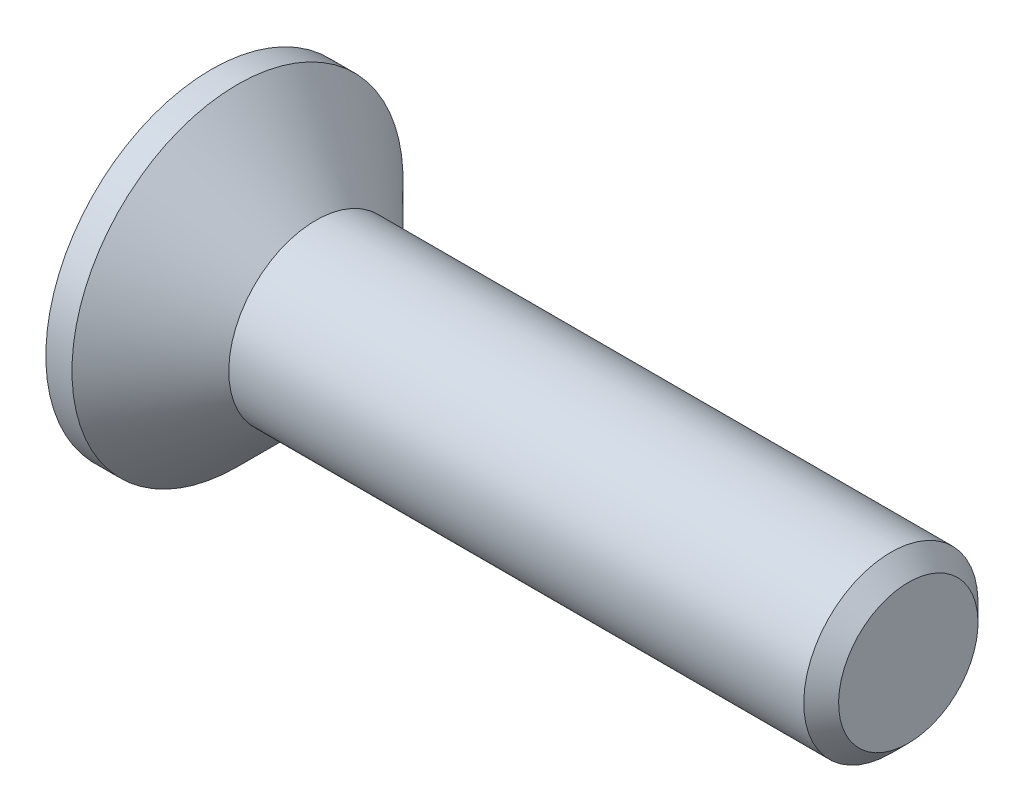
ISO-10303-21;
HEADER;
FILE_DESCRIPTION(('STEP AP214'),'2;1');
FILE_NAME('part.step','',(''),(''),'','','');
FILE_SCHEMA(('AUTOMOTIVE_DESIGN { 1 0 10303 214 1 1 1 1 }'));
ENDSEC;
DATA;
#1=APPLICATION_CONTEXT('core data for automotive mechanical design processes');
#2=APPLICATION_PROTOCOL_DEFINITION('international standard','automotive_design',2000,#1);
#3=PRODUCT_CONTEXT('',#1,'mechanical');
#4=PRODUCT('Part','Part','',(#3));
#5=PRODUCT_RELATED_PRODUCT_CATEGORY('part','',(#4));
#6=PRODUCT_DEFINITION_FORMATION('','',#4);
#7=PRODUCT_DEFINITION_CONTEXT('part definition',#1,'design');
#8=PRODUCT_DEFINITION('design','',#6,#7);
#9=PRODUCT_DEFINITION_SHAPE('','',#8);
#10=(LENGTH_UNIT() NAMED_UNIT(*) SI_UNIT(.MILLI.,.METRE.));
#11=(NAMED_UNIT(*) PLANE_ANGLE_UNIT() SI_UNIT($,.RADIAN.));
#12=(NAMED_UNIT(*) SI_UNIT($,.STERADIAN.) SOLID_ANGLE_UNIT());
#13=UNCERTAINTY_MEASURE_WITH_UNIT(LENGTH_MEASURE(1.E-05),#10,'distance_accuracy_value','');
#14=(GEOMETRIC_REPRESENTATION_CONTEXT(3) GLOBAL_UNCERTAINTY_ASSIGNED_CONTEXT((#13)) GLOBAL_UNIT_ASSIGNED_CONTEXT((#10,
#11,#12)) REPRESENTATION_CONTEXT('',''));
#15=CARTESIAN_POINT('',(0.,0.,0.));
#16=DIRECTION('',(0.,0.,1.));
#17=DIRECTION('',(1.,0.,0.));
#18=AXIS2_PLACEMENT_3D('',#15,#16,#17);
#19=CARTESIAN_POINT('',(0.,0.,0.));
#20=DIRECTION('',(-1.,0.,0.));
#21=DIRECTION('',(0.,-1.,0.));
#22=AXIS2_PLACEMENT_3D('',#19,#20,#21);
#23=CONICAL_SURFACE('',#22,1.,0.78539816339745);
#24=CARTESIAN_POINT('',(-0.899999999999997,0.,0.));
#25=DIRECTION('',(-1.,0.,0.));
#26=DIRECTION('',(0.,-1.,0.));
#27=AXIS2_PLACEMENT_3D('',#24,#25,#26);
#28=CIRCLE('',#27,1.9);
#29=CARTESIAN_POINT('',(-0.899999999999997,-1.9,0.));
#30=VERTEX_POINT('',#29);
#31=EDGE_CURVE('E189',#30,#30,#28,.T.);
#32=ORIENTED_EDGE('',*,*,#31,.F.);
#33=EDGE_LOOP('',(#32));
#34=FACE_BOUND('',#33,.T.);
#35=CARTESIAN_POINT('',(0.,0.,0.));
#36=DIRECTION('',(-1.,0.,0.));
#37=DIRECTION('',(0.,-1.,0.));
#38=AXIS2_PLACEMENT_3D('',#35,#36,#37);
#39=CIRCLE('',#38,1.);
#40=CARTESIAN_POINT('',(0.,-1.,0.));
#41=VERTEX_POINT('',#40);
#42=EDGE_CURVE('E212',#41,#41,#39,.T.);
#43=ORIENTED_EDGE('',*,*,#42,.T.);
#44=EDGE_LOOP('',(#43));
#45=FACE_BOUND('',#44,.T.);
#46=ADVANCED_FACE('F33',(#34,#45),#23,.T.);
#47=CARTESIAN_POINT('',(-1.2,0.,0.));
#48=DIRECTION('',(-1.,0.,0.));
#49=DIRECTION('',(0.,-1.,0.));
#50=AXIS2_PLACEMENT_3D('',#47,#48,#49);
#51=CYLINDRICAL_SURFACE('',#50,1.);
#52=CARTESIAN_POINT('',(6.6,0.,0.));
#53=DIRECTION('',(-1.,0.,0.));
#54=DIRECTION('',(0.,-1.,0.));
#55=AXIS2_PLACEMENT_3D('',#52,#53,#54);
#56=CIRCLE('',#55,1.);
#57=CARTESIAN_POINT('',(6.6,-1.,0.));
#58=VERTEX_POINT('',#57);
#59=EDGE_CURVE('E41',#58,#58,#56,.T.);
#60=ORIENTED_EDGE('',*,*,#59,.T.);
#61=EDGE_LOOP('',(#60));
#62=FACE_BOUND('',#61,.T.);
#63=ORIENTED_EDGE('',*,*,#42,.F.);
#64=EDGE_LOOP('',(#63));
#65=FACE_BOUND('',#64,.T.);
#66=ADVANCED_FACE('F217',(#62,#65),#51,.T.);
#67=CARTESIAN_POINT('',(6.8,0.,0.));
#68=DIRECTION('',(-1.,0.,0.));
#69=DIRECTION('',(0.,-1.,0.));
#70=AXIS2_PLACEMENT_3D('',#67,#68,#69);
#71=PLANE('',#70);
#72=CARTESIAN_POINT('',(6.8,0.,0.));
#73=DIRECTION('',(-1.,0.,0.));
#74=DIRECTION('',(0.,-1.,0.));
#75=AXIS2_PLACEMENT_3D('',#72,#73,#74);
#76=CIRCLE('',#75,0.8);
#77=CARTESIAN_POINT('',(6.8,-0.8,0.));
#78=VERTEX_POINT('',#77);
#79=EDGE_CURVE('E11',#78,#78,#76,.F.);
#80=ORIENTED_EDGE('',*,*,#79,.T.);
#81=EDGE_LOOP('',(#80));
#82=FACE_BOUND('',#81,.T.);
#83=ADVANCED_FACE('F239',(#82),#71,.F.);
#84=CARTESIAN_POINT('',(-1.2,1.9,0.));
#85=DIRECTION('',(1.,0.,0.));
#86=DIRECTION('',(0.,1.,0.));
#87=AXIS2_PLACEMENT_3D('',#84,#85,#86);
#88=PLANE('',#87);
#89=DIRECTION('',(0.,0.,-1.));
#90=VECTOR('',#89,1.);
#91=CARTESIAN_POINT('',(-1.2,0.3,-1.175));
#92=LINE('',#91,#90);
#93=CARTESIAN_POINT('',(-1.2,0.3,-0.3));
#94=VERTEX_POINT('',#93);
#95=CARTESIAN_POINT('',(-1.2,0.3,-1.175));
#96=VERTEX_POINT('',#95);
#97=EDGE_CURVE('E158',#94,#96,#92,.T.);
#98=ORIENTED_EDGE('',*,*,#97,.F.);
#99=DIRECTION('',(0.,-1.,0.));
#100=VECTOR('',#99,1.);
#101=CARTESIAN_POINT('',(-1.2,0.3,-0.3));
#102=LINE('',#101,#100);
#103=CARTESIAN_POINT('',(-1.2,1.175,-0.3));
#104=VERTEX_POINT('',#103);
#105=EDGE_CURVE('E48',#104,#94,#102,.T.);
#106=ORIENTED_EDGE('',*,*,#105,.F.);
#107=DIRECTION('',(0.,0.,-1.));
#108=VECTOR('',#107,1.);
#109=CARTESIAN_POINT('',(-1.2,1.175,-0.3));
#110=LINE('',#109,#108);
#111=CARTESIAN_POINT('',(-1.2,1.175,0.3));
#112=VERTEX_POINT('',#111);
#113=EDGE_CURVE('E185',#112,#104,#110,.T.);
#114=ORIENTED_EDGE('',*,*,#113,.F.);
#115=DIRECTION('',(0.,1.,0.));
#116=VECTOR('',#115,1.);
#117=CARTESIAN_POINT('',(-1.2,1.175,0.3));
#118=LINE('',#117,#116);
#119=CARTESIAN_POINT('',(-1.2,0.3,0.3));
#120=VERTEX_POINT('',#119);
#121=EDGE_CURVE('E183',#120,#112,#118,.T.);
#122=ORIENTED_EDGE('',*,*,#121,.F.);
#123=DIRECTION('',(0.,0.,-1.));
#124=VECTOR('',#123,1.);
#125=CARTESIAN_POINT('',(-1.2,0.3,0.3));
#126=LINE('',#125,#124);
#127=CARTESIAN_POINT('',(-1.2,0.3,1.175));
#128=VERTEX_POINT('',#127);
#129=EDGE_CURVE('E132',#128,#120,#126,.T.);
#130=ORIENTED_EDGE('',*,*,#129,.F.);
#131=DIRECTION('',(0.,1.,0.));
#132=VECTOR('',#131,1.);
#133=CARTESIAN_POINT('',(-1.2,0.3,1.175));
#134=LINE('',#133,#132);
#135=CARTESIAN_POINT('',(-1.2,-0.3,1.175));
#136=VERTEX_POINT('',#135);
#137=EDGE_CURVE('E179',#136,#128,#134,.T.);
#138=ORIENTED_EDGE('',*,*,#137,.F.);
#139=DIRECTION('',(0.,0.,1.));
#140=VECTOR('',#139,1.);
#141=CARTESIAN_POINT('',(-1.2,-0.3,1.175));
#142=LINE('',#141,#140);
#143=CARTESIAN_POINT('',(-1.2,-0.3,0.3));
#144=VERTEX_POINT('',#143);
#145=EDGE_CURVE('E176',#144,#136,#142,.T.);
#146=ORIENTED_EDGE('',*,*,#145,.F.);
#147=DIRECTION('',(0.,1.,0.));
#148=VECTOR('',#147,1.);
#149=CARTESIAN_POINT('',(-1.2,-0.3,0.3));
#150=LINE('',#149,#148);
#151=CARTESIAN_POINT('',(-1.2,-1.175,0.3));
#152=VERTEX_POINT('',#151);
#153=EDGE_CURVE('E173',#152,#144,#150,.T.);
#154=ORIENTED_EDGE('',*,*,#153,.F.);
#155=DIRECTION('',(0.,0.,1.));
#156=VECTOR('',#155,1.);
#157=CARTESIAN_POINT('',(-1.2,-1.175,0.3));
#158=LINE('',#157,#156);
#159=CARTESIAN_POINT('',(-1.2,-1.175,-0.3));
#160=VERTEX_POINT('',#159);
#161=EDGE_CURVE('E170',#160,#152,#158,.T.);
#162=ORIENTED_EDGE('',*,*,#161,.F.);
#163=DIRECTION('',(0.,-1.,0.));
#164=VECTOR('',#163,1.);
#165=CARTESIAN_POINT('',(-1.2,-1.175,-0.3));
#166=LINE('',#165,#164);
#167=CARTESIAN_POINT('',(-1.2,-0.3,-0.3));
#168=VERTEX_POINT('',#167);
#169=EDGE_CURVE('E167',#168,#160,#166,.T.);
#170=ORIENTED_EDGE('',*,*,#169,.F.);
#171=DIRECTION('',(0.,0.,1.));
#172=VECTOR('',#171,1.);
#173=CARTESIAN_POINT('',(-1.2,-0.3,-0.3));
#174=LINE('',#173,#172);
#175=CARTESIAN_POINT('',(-1.2,-0.3,-1.175));
#176=VERTEX_POINT('',#175);
#177=EDGE_CURVE('E164',#176,#168,#174,.T.);
#178=ORIENTED_EDGE('',*,*,#177,.F.);
#179=DIRECTION('',(0.,-1.,0.));
#180=VECTOR('',#179,1.);
#181=CARTESIAN_POINT('',(-1.2,-0.3,-1.175));
#182=LINE('',#181,#180);
#183=EDGE_CURVE('E161',#96,#176,#182,.T.);
#184=ORIENTED_EDGE('',*,*,#183,.F.);
#185=EDGE_LOOP('',(#98,#106,#114,#122,#130,#138,#146,#154,#162,#170,#178,#184));
#186=FACE_BOUND('',#185,.T.);
#187=CARTESIAN_POINT('',(-1.2,0.,0.));
#188=DIRECTION('',(-1.,0.,0.));
#189=DIRECTION('',(0.,-1.,0.));
#190=AXIS2_PLACEMENT_3D('',#187,#188,#189);
#191=CIRCLE('',#190,1.9);
#192=CARTESIAN_POINT('',(-1.2,-1.9,0.));
#193=VERTEX_POINT('',#192);
#194=EDGE_CURVE('E209',#193,#193,#191,.T.);
#195=ORIENTED_EDGE('',*,*,#194,.T.);
#196=EDGE_LOOP('',(#195));
#197=FACE_BOUND('',#196,.T.);
#198=ADVANCED_FACE('F230',(#186,#197),#88,.F.);
#199=CARTESIAN_POINT('',(-1.2,0.,0.));
#200=DIRECTION('',(-1.,0.,0.));
#201=DIRECTION('',(0.,-1.,0.));
#202=AXIS2_PLACEMENT_3D('',#199,#200,#201);
#203=CYLINDRICAL_SURFACE('',#202,1.9);
#204=ORIENTED_EDGE('',*,*,#194,.F.);
#205=EDGE_LOOP('',(#204));
#206=FACE_BOUND('',#205,.T.);
#207=ORIENTED_EDGE('',*,*,#31,.T.);
#208=EDGE_LOOP('',(#207));
#209=FACE_BOUND('',#208,.T.);
#210=ADVANCED_FACE('F222',(#206,#209),#203,.T.);
#211=CARTESIAN_POINT('',(6.6,0.,0.));
#212=DIRECTION('',(-1.,0.,0.));
#213=DIRECTION('',(0.,-1.,0.));
#214=AXIS2_PLACEMENT_3D('',#211,#212,#213);
#215=CONICAL_SURFACE('',#214,1.,0.78539816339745);
#216=ORIENTED_EDGE('',*,*,#79,.F.);
#217=EDGE_LOOP('',(#216));
#218=FACE_BOUND('',#217,.T.);
#219=ORIENTED_EDGE('',*,*,#59,.F.);
#220=EDGE_LOOP('',(#219));
#221=FACE_BOUND('',#220,.T.);
#222=ADVANCED_FACE('F35',(#218,#221),#215,.T.);
#223=CARTESIAN_POINT('',(-0.249999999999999,0.3,-0.3));
#224=DIRECTION('',(0.,0.,-1.));
#225=DIRECTION('',(0.,1.,0.));
#226=AXIS2_PLACEMENT_3D('',#223,#224,#225);
#227=PLANE('',#226);
#228=ORIENTED_EDGE('',*,*,#105,.T.);
#229=DIRECTION('',(-1.,0.,0.));
#230=VECTOR('',#229,1.);
#231=CARTESIAN_POINT('',(-0.249999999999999,0.3,-0.3));
#232=LINE('',#231,#230);
#233=CARTESIAN_POINT('',(-0.249999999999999,0.3,-0.3));
#234=VERTEX_POINT('',#233);
#235=EDGE_CURVE('E96',#234,#94,#232,.T.);
#236=ORIENTED_EDGE('',*,*,#235,.F.);
#237=DIRECTION('',(0.,-1.,0.));
#238=VECTOR('',#237,1.);
#239=CARTESIAN_POINT('',(-0.249999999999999,0.3,-0.3));
#240=LINE('',#239,#238);
#241=CARTESIAN_POINT('',(-0.249999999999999,1.175,-0.3));
#242=VERTEX_POINT('',#241);
#243=EDGE_CURVE('E187',#242,#234,#240,.T.);
#244=ORIENTED_EDGE('',*,*,#243,.F.);
#245=DIRECTION('',(-1.,0.,0.));
#246=VECTOR('',#245,1.);
#247=CARTESIAN_POINT('',(-0.249999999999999,1.175,-0.3));
#248=LINE('',#247,#246);
#249=EDGE_CURVE('E56',#242,#104,#248,.T.);
#250=ORIENTED_EDGE('',*,*,#249,.T.);
#251=EDGE_LOOP('',(#228,#236,#244,#250));
#252=FACE_BOUND('',#251,.T.);
#253=ADVANCED_FACE('F221',(#252),#227,.F.);
#254=CARTESIAN_POINT('',(-0.249999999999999,1.175,-0.3));
#255=DIRECTION('',(0.,1.,0.));
#256=DIRECTION('',(-1.,0.,0.));
#257=AXIS2_PLACEMENT_3D('',#254,#255,#256);
#258=PLANE('',#257);
#259=ORIENTED_EDGE('',*,*,#113,.T.);
#260=ORIENTED_EDGE('',*,*,#249,.F.);
#261=DIRECTION('',(0.,0.,-1.));
#262=VECTOR('',#261,1.);
#263=CARTESIAN_POINT('',(-0.249999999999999,1.175,-0.3));
#264=LINE('',#263,#262);
#265=CARTESIAN_POINT('',(-0.249999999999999,1.175,0.3));
#266=VERTEX_POINT('',#265);
#267=EDGE_CURVE('E144',#266,#242,#264,.T.);
#268=ORIENTED_EDGE('',*,*,#267,.F.);
#269=DIRECTION('',(-1.,0.,0.));
#270=VECTOR('',#269,1.);
#271=CARTESIAN_POINT('',(-0.249999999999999,1.175,0.3));
#272=LINE('',#271,#270);
#273=EDGE_CURVE('E136',#266,#112,#272,.T.);
#274=ORIENTED_EDGE('',*,*,#273,.T.);
#275=EDGE_LOOP('',(#259,#260,#268,#274));
#276=FACE_BOUND('',#275,.T.);
#277=ADVANCED_FACE('F228',(#276),#258,.F.);
#278=CARTESIAN_POINT('',(-0.249999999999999,1.175,0.3));
#279=DIRECTION('',(0.,0.,1.));
#280=DIRECTION('',(0.,-1.,0.));
#281=AXIS2_PLACEMENT_3D('',#278,#279,#280);
#282=PLANE('',#281);
#283=ORIENTED_EDGE('',*,*,#121,.T.);
#284=ORIENTED_EDGE('',*,*,#273,.F.);
#285=DIRECTION('',(0.,1.,0.));
#286=VECTOR('',#285,1.);
#287=CARTESIAN_POINT('',(-0.249999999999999,1.175,0.3));
#288=LINE('',#287,#286);
#289=CARTESIAN_POINT('',(-0.249999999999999,0.3,0.3));
#290=VERTEX_POINT('',#289);
#291=EDGE_CURVE('E140',#290,#266,#288,.T.);
#292=ORIENTED_EDGE('',*,*,#291,.F.);
#293=DIRECTION('',(-1.,0.,0.));
#294=VECTOR('',#293,1.);
#295=CARTESIAN_POINT('',(-0.249999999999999,0.3,0.3));
#296=LINE('',#295,#294);
#297=EDGE_CURVE('E125',#290,#120,#296,.T.);
#298=ORIENTED_EDGE('',*,*,#297,.T.);
#299=EDGE_LOOP('',(#283,#284,#292,#298));
#300=FACE_BOUND('',#299,.T.);
#301=ADVANCED_FACE('F141',(#300),#282,.F.);
#302=CARTESIAN_POINT('',(-0.249999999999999,0.3,0.3));
#303=DIRECTION('',(0.,1.,0.));
#304=DIRECTION('',(0.,0.,1.));
#305=AXIS2_PLACEMENT_3D('',#302,#303,#304);
#306=PLANE('',#305);
#307=ORIENTED_EDGE('',*,*,#129,.T.);
#308=ORIENTED_EDGE('',*,*,#297,.F.);
#309=DIRECTION('',(0.,0.,-1.));
#310=VECTOR('',#309,1.);
#311=CARTESIAN_POINT('',(-0.249999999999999,0.3,0.3));
#312=LINE('',#311,#310);
#313=CARTESIAN_POINT('',(-0.249999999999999,0.3,1.175));
#314=VERTEX_POINT('',#313);
#315=EDGE_CURVE('E129',#314,#290,#312,.T.);
#316=ORIENTED_EDGE('',*,*,#315,.F.);
#317=DIRECTION('',(-1.,0.,0.));
#318=VECTOR('',#317,1.);
#319=CARTESIAN_POINT('',(-0.249999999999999,0.3,1.175));
#320=LINE('',#319,#318);
#321=EDGE_CURVE('E137',#314,#128,#320,.T.);
#322=ORIENTED_EDGE('',*,*,#321,.T.);
#323=EDGE_LOOP('',(#307,#308,#316,#322));
#324=FACE_BOUND('',#323,.T.);
#325=ADVANCED_FACE('F127',(#324),#306,.F.);
#326=CARTESIAN_POINT('',(-0.249999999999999,0.3,1.175));
#327=DIRECTION('',(0.,0.,1.));
#328=DIRECTION('',(1.,0.,0.));
#329=AXIS2_PLACEMENT_3D('',#326,#327,#328);
#330=PLANE('',#329);
#331=ORIENTED_EDGE('',*,*,#137,.T.);
#332=ORIENTED_EDGE('',*,*,#321,.F.);
#333=DIRECTION('',(0.,1.,0.));
#334=VECTOR('',#333,1.);
#335=CARTESIAN_POINT('',(-0.249999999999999,0.3,1.175));
#336=LINE('',#335,#334);
#337=CARTESIAN_POINT('',(-0.249999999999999,-0.3,1.175));
#338=VERTEX_POINT('',#337);
#339=EDGE_CURVE('E150',#338,#314,#336,.T.);
#340=ORIENTED_EDGE('',*,*,#339,.F.);
#341=DIRECTION('',(-1.,0.,0.));
#342=VECTOR('',#341,1.);
#343=CARTESIAN_POINT('',(-0.249999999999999,-0.3,1.175));
#344=LINE('',#343,#342);
#345=EDGE_CURVE('E192',#338,#136,#344,.T.);
#346=ORIENTED_EDGE('',*,*,#345,.T.);
#347=EDGE_LOOP('',(#331,#332,#340,#346));
#348=FACE_BOUND('',#347,.T.);
#349=ADVANCED_FACE('F277',(#348),#330,.F.);
#350=CARTESIAN_POINT('',(-0.249999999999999,-0.3,1.175));
#351=DIRECTION('',(0.,-1.,0.));
#352=DIRECTION('',(0.,0.,-1.));
#353=AXIS2_PLACEMENT_3D('',#350,#351,#352);
#354=PLANE('',#353);
#355=ORIENTED_EDGE('',*,*,#145,.T.);
#356=ORIENTED_EDGE('',*,*,#345,.F.);
#357=DIRECTION('',(0.,0.,1.));
#358=VECTOR('',#357,1.);
#359=CARTESIAN_POINT('',(-0.249999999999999,-0.3,1.175));
#360=LINE('',#359,#358);
#361=CARTESIAN_POINT('',(-0.249999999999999,-0.3,0.3));
#362=VERTEX_POINT('',#361);
#363=EDGE_CURVE('E152',#362,#338,#360,.T.);
#364=ORIENTED_EDGE('',*,*,#363,.F.);
#365=DIRECTION('',(-1.,0.,0.));
#366=VECTOR('',#365,1.);
#367=CARTESIAN_POINT('',(-0.249999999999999,-0.3,0.3));
#368=LINE('',#367,#366);
#369=EDGE_CURVE('E194',#362,#144,#368,.T.);
#370=ORIENTED_EDGE('',*,*,#369,.T.);
#371=EDGE_LOOP('',(#355,#356,#364,#370));
#372=FACE_BOUND('',#371,.T.);
#373=ADVANCED_FACE('F273',(#372),#354,.F.);
#374=CARTESIAN_POINT('',(-0.249999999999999,-0.3,0.3));
#375=DIRECTION('',(0.,0.,1.));
#376=DIRECTION('',(1.,0.,0.));
#377=AXIS2_PLACEMENT_3D('',#374,#375,#376);
#378=PLANE('',#377);
#379=ORIENTED_EDGE('',*,*,#153,.T.);
#380=ORIENTED_EDGE('',*,*,#369,.F.);
#381=DIRECTION('',(0.,1.,0.));
#382=VECTOR('',#381,1.);
#383=CARTESIAN_POINT('',(-0.249999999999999,-0.3,0.3));
#384=LINE('',#383,#382);
#385=CARTESIAN_POINT('',(-0.249999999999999,-1.175,0.3));
#386=VERTEX_POINT('',#385);
#387=EDGE_CURVE('E422',#386,#362,#384,.T.);
#388=ORIENTED_EDGE('',*,*,#387,.F.);
#389=DIRECTION('',(-1.,0.,0.));
#390=VECTOR('',#389,1.);
#391=CARTESIAN_POINT('',(-0.249999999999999,-1.175,0.3));
#392=LINE('',#391,#390);
#393=EDGE_CURVE('E196',#386,#152,#392,.T.);
#394=ORIENTED_EDGE('',*,*,#393,.T.);
#395=EDGE_LOOP('',(#379,#380,#388,#394));
#396=FACE_BOUND('',#395,.T.);
#397=ADVANCED_FACE('F269',(#396),#378,.F.);
#398=CARTESIAN_POINT('',(-0.249999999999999,-1.175,0.3));
#399=DIRECTION('',(0.,-1.,0.));
#400=DIRECTION('',(1.,0.,0.));
#401=AXIS2_PLACEMENT_3D('',#398,#399,#400);
#402=PLANE('',#401);
#403=ORIENTED_EDGE('',*,*,#161,.T.);
#404=ORIENTED_EDGE('',*,*,#393,.F.);
#405=DIRECTION('',(0.,0.,1.));
#406=VECTOR('',#405,1.);
#407=CARTESIAN_POINT('',(-0.249999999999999,-1.175,0.3));
#408=LINE('',#407,#406);
#409=CARTESIAN_POINT('',(-0.249999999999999,-1.175,-0.3));
#410=VERTEX_POINT('',#409);
#411=EDGE_CURVE('E419',#410,#386,#408,.T.);
#412=ORIENTED_EDGE('',*,*,#411,.F.);
#413=DIRECTION('',(-1.,0.,0.));
#414=VECTOR('',#413,1.);
#415=CARTESIAN_POINT('',(-0.249999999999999,-1.175,-0.3));
#416=LINE('',#415,#414);
#417=EDGE_CURVE('E198',#410,#160,#416,.T.);
#418=ORIENTED_EDGE('',*,*,#417,.T.);
#419=EDGE_LOOP('',(#403,#404,#412,#418));
#420=FACE_BOUND('',#419,.T.);
#421=ADVANCED_FACE('F265',(#420),#402,.F.);
#422=CARTESIAN_POINT('',(-0.249999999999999,-1.175,-0.3));
#423=DIRECTION('',(0.,0.,-1.));
#424=DIRECTION('',(0.,1.,0.));
#425=AXIS2_PLACEMENT_3D('',#422,#423,#424);
#426=PLANE('',#425);
#427=ORIENTED_EDGE('',*,*,#169,.T.);
#428=ORIENTED_EDGE('',*,*,#417,.F.);
#429=DIRECTION('',(0.,-1.,0.));
#430=VECTOR('',#429,1.);
#431=CARTESIAN_POINT('',(-0.249999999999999,-1.175,-0.3));
#432=LINE('',#431,#430);
#433=CARTESIAN_POINT('',(-0.249999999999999,-0.3,-0.3));
#434=VERTEX_POINT('',#433);
#435=EDGE_CURVE('E416',#434,#410,#432,.T.);
#436=ORIENTED_EDGE('',*,*,#435,.F.);
#437=DIRECTION('',(-1.,0.,0.));
#438=VECTOR('',#437,1.);
#439=CARTESIAN_POINT('',(-0.249999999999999,-0.3,-0.3));
#440=LINE('',#439,#438);
#441=EDGE_CURVE('E200',#434,#168,#440,.T.);
#442=ORIENTED_EDGE('',*,*,#441,.T.);
#443=EDGE_LOOP('',(#427,#428,#436,#442));
#444=FACE_BOUND('',#443,.T.);
#445=ADVANCED_FACE('F261',(#444),#426,.F.);
#446=CARTESIAN_POINT('',(-0.249999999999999,-0.3,-0.3));
#447=DIRECTION('',(0.,-1.,0.));
#448=DIRECTION('',(0.,0.,-1.));
#449=AXIS2_PLACEMENT_3D('',#446,#447,#448);
#450=PLANE('',#449);
#451=ORIENTED_EDGE('',*,*,#177,.T.);
#452=ORIENTED_EDGE('',*,*,#441,.F.);
#453=DIRECTION('',(0.,0.,1.));
#454=VECTOR('',#453,1.);
#455=CARTESIAN_POINT('',(-0.249999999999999,-0.3,-0.3));
#456=LINE('',#455,#454);
#457=CARTESIAN_POINT('',(-0.249999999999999,-0.3,-1.175));
#458=VERTEX_POINT('',#457);
#459=EDGE_CURVE('E413',#458,#434,#456,.T.);
#460=ORIENTED_EDGE('',*,*,#459,.F.);
#461=DIRECTION('',(-1.,0.,0.));
#462=VECTOR('',#461,1.);
#463=CARTESIAN_POINT('',(-0.249999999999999,-0.3,-1.175));
#464=LINE('',#463,#462);
#465=EDGE_CURVE('E202',#458,#176,#464,.T.);
#466=ORIENTED_EDGE('',*,*,#465,.T.);
#467=EDGE_LOOP('',(#451,#452,#460,#466));
#468=FACE_BOUND('',#467,.T.);
#469=ADVANCED_FACE('F257',(#468),#450,.F.);
#470=CARTESIAN_POINT('',(-0.249999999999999,-0.3,-1.175));
#471=DIRECTION('',(0.,0.,-1.));
#472=DIRECTION('',(-1.,0.,0.));
#473=AXIS2_PLACEMENT_3D('',#470,#471,#472);
#474=PLANE('',#473);
#475=ORIENTED_EDGE('',*,*,#183,.T.);
#476=ORIENTED_EDGE('',*,*,#465,.F.);
#477=DIRECTION('',(0.,-1.,0.));
#478=VECTOR('',#477,1.);
#479=CARTESIAN_POINT('',(-0.249999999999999,-0.3,-1.175));
#480=LINE('',#479,#478);
#481=CARTESIAN_POINT('',(-0.249999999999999,0.3,-1.175));
#482=VERTEX_POINT('',#481);
#483=EDGE_CURVE('E408',#482,#458,#480,.T.);
#484=ORIENTED_EDGE('',*,*,#483,.F.);
#485=DIRECTION('',(-1.,0.,0.));
#486=VECTOR('',#485,1.);
#487=CARTESIAN_POINT('',(-0.249999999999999,0.3,-1.175));
#488=LINE('',#487,#486);
#489=EDGE_CURVE('E204',#482,#96,#488,.T.);
#490=ORIENTED_EDGE('',*,*,#489,.T.);
#491=EDGE_LOOP('',(#475,#476,#484,#490));
#492=FACE_BOUND('',#491,.T.);
#493=ADVANCED_FACE('F253',(#492),#474,.F.);
#494=CARTESIAN_POINT('',(-0.249999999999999,0.3,-1.175));
#495=DIRECTION('',(0.,1.,0.));
#496=DIRECTION('',(0.,0.,1.));
#497=AXIS2_PLACEMENT_3D('',#494,#495,#496);
#498=PLANE('',#497);
#499=ORIENTED_EDGE('',*,*,#97,.T.);
#500=ORIENTED_EDGE('',*,*,#489,.F.);
#501=DIRECTION('',(0.,0.,-1.));
#502=VECTOR('',#501,1.);
#503=CARTESIAN_POINT('',(-0.249999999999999,0.3,-1.175));
#504=LINE('',#503,#502);
#505=EDGE_CURVE('E406',#234,#482,#504,.T.);
#506=ORIENTED_EDGE('',*,*,#505,.F.);
#507=ORIENTED_EDGE('',*,*,#235,.T.);
#508=EDGE_LOOP('',(#499,#500,#506,#507));
#509=FACE_BOUND('',#508,.T.);
#510=ADVANCED_FACE('F250',(#509),#498,.F.);
#511=CARTESIAN_POINT('',(-0.249999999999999,0.,0.));
#512=DIRECTION('',(1.,0.,0.));
#513=DIRECTION('',(0.,0.,-1.));
#514=AXIS2_PLACEMENT_3D('',#511,#512,#513);
#515=PLANE('',#514);
#516=ORIENTED_EDGE('',*,*,#243,.T.);
#517=ORIENTED_EDGE('',*,*,#505,.T.);
#518=ORIENTED_EDGE('',*,*,#483,.T.);
#519=ORIENTED_EDGE('',*,*,#459,.T.);
#520=ORIENTED_EDGE('',*,*,#435,.T.);
#521=ORIENTED_EDGE('',*,*,#411,.T.);
#522=ORIENTED_EDGE('',*,*,#387,.T.);
#523=ORIENTED_EDGE('',*,*,#363,.T.);
#524=ORIENTED_EDGE('',*,*,#339,.T.);
#525=ORIENTED_EDGE('',*,*,#315,.T.);
#526=ORIENTED_EDGE('',*,*,#291,.T.);
#527=ORIENTED_EDGE('',*,*,#267,.T.);
#528=EDGE_LOOP('',(#516,#517,#518,#519,#520,#521,#522,#523,#524,#525,#526,#527));
#529=FACE_BOUND('',#528,.T.);
#530=ADVANCED_FACE('F147',(#529),#515,.F.);
#531=CLOSED_SHELL('',(#46,#66,#83,#198,#210,#222,#253,#277,#301,#325,#349,#373,#397,#421,#445,
#469,#493,#510,#530));
#532=MANIFOLD_SOLID_BREP('B2',#531);
#533=ADVANCED_BREP_SHAPE_REPRESENTATION('',(#18,#532),#14);
#534=SHAPE_DEFINITION_REPRESENTATION(#9,#533);
ENDSEC;
END-ISO-10303-21;
